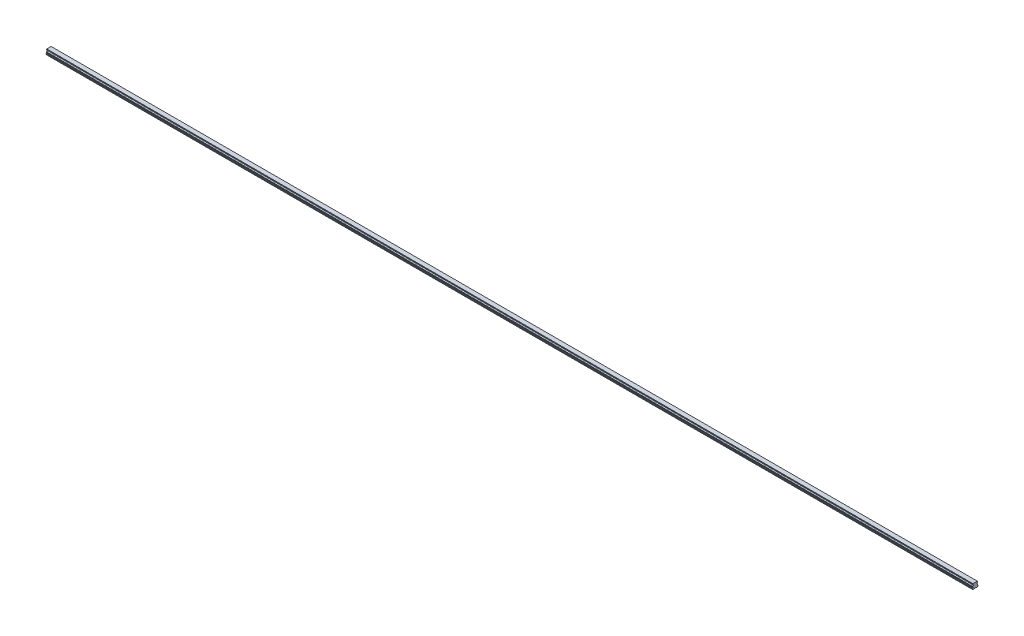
from build123d import *

# Parameters (mm, degrees)
BOSS_EXTRUDE1_DEPTH        = 3960
SKETCH3_R                  = 3
SKETCH3_R_2                = 2.5
CUT_EXTRUDE3_DEPTH         = 12
SKETCH3_2_R                = 2.5
CUT_EXTRUDE4_DEPTH         = 15
CHAMFER1_SIZE              = 0.5
LPATTERN4_COUNT            = 66
LPATTERN4_PITCH            = 60
CHAMFER1_OF_LPATTERN4_SIZE = 0.5


with BuildPart() as part:
    # Sketch1 → Boss-Extrude1 (new body)
    with BuildSketch(Plane(origin=(0, 0, 0), x_dir=(0, 0, -1), z_dir=(1, 0, 0))):
        with BuildLine():
            Line((9.375, 21.8), (-9.375, 21.8))
            Line((-9.375, 21.8), (-9.375, 20.756))
            Line((-9.375, 20.756), (-10, 19.415683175))
            Line((-10, 19.415683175), (-10, 17.685449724))
            ThreePointArc((-10, 17.685449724), (-7.2, 14.6), (-10, 11.514550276))
            Line((-10, 11.514550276), (-10, 9.784316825))
            Line((-10, 9.784316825), (-9.375, 8.444))
            Line((-9.375, 8.444), (-9.922688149, 6.4))
            Line((-9.922688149, 6.4), (-12.5, 5.489338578))
            Line((-12.5, 5.489338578), (-12.5, 2.65))
            Line((-12.5, 2.65), (-9.85, 0))
            Line((-9.85, 0), (-5.5, 0))
            Line((-5.5, 0), (-5, 0.5))
            Line((-5, 0.5), (5, 0.5))
            Line((5, 0.5), (5.5, 0))
            Line((5.5, 0), (9.85, 0))
            Line((9.85, 0), (12.5, 2.65))
            Line((12.5, 2.65), (12.5, 5.489338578))
            Line((12.5, 5.489338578), (9.922688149, 6.4))
            Line((9.922688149, 6.4), (9.375, 8.444))
            Line((9.375, 8.444), (10, 9.784316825))
            Line((10, 9.784316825), (10, 11.514550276))
            ThreePointArc((10, 11.514550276), (7.2, 14.6), (10, 17.685449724))
            Line((10, 17.685449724), (10, 19.415683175))
            Line((10, 19.415683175), (9.375, 20.756))
            Line((9.375, 20.756), (9.375, 21.8))
        make_face()
    extrude(amount=BOSS_EXTRUDE1_DEPTH)

    # Sketch3 → Cut-Extrude3 (cut)
    with BuildSketch(Plane.XZ):
        with Locations(Location((30, 0, 0), (0, 0, 270))):
            Circle(SKETCH3_R)
        with Locations(Location((30, 0, 0), (0, 0, 270))):
            Circle(SKETCH3_R_2, mode=Mode.SUBTRACT)
    cut_extrude3 = extrude(amount=-CUT_EXTRUDE3_DEPTH, mode=Mode.SUBTRACT)

    # Sketch3_2 → Cut-Extrude4 (cut)
    with BuildSketch(Plane.XZ):
        with Locations(Location((30, 0, 0), (0, 0, 270))):
            Circle(SKETCH3_2_R)
    cut_extrude4 = extrude(amount=-CUT_EXTRUDE4_DEPTH, mode=Mode.SUBTRACT)

    # Cut-Extrude5 cone 1 section (on through the dimple's axis) → Cut-Extrude5 (revolve, cut)
    with BuildSketch(Plane(origin=(30, 15, 0), x_dir=(0, 0, -1), z_dir=(1, 0, 0))):
        Polygon((0, 0), (2.5, 0), (0, 1.443375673), align=None)
    cut_extrude5 = revolve(axis=Axis((30, 15, 0), (0, 1, 0)), mode=Mode.SUBTRACT)

    # Chamfer1
    chamfer1_edges = [part.edges().sort_by_distance(p)[0] for p in [
        (30, 0.5, 3),
    ]]
    chamfer(chamfer1_edges, length=CHAMFER1_SIZE)

    # LPattern4: Cut-Extrude3, Cut-Extrude4, Cut-Extrude5 ×66
    with Locations(*[(i * LPATTERN4_PITCH, 0, 0) for i in range(1, LPATTERN4_COUNT)]):
        add(cut_extrude3, mode=Mode.SUBTRACT)
        add(cut_extrude4, mode=Mode.SUBTRACT)
        add(cut_extrude5, mode=Mode.SUBTRACT)

    # Chamfer1 of LPattern4
    chamfer1_of_lpattern4_edges = [part.edges().sort_by_distance(p)[0] for p in [
        (90, 0.5, 3),
        (150, 0.5, 3),
        (210, 0.5, 3),
        (270, 0.5, 3),
        (330, 0.5, 3),
        (390, 0.5, 3),
        (450, 0.5, 3),
        (510, 0.5, 3),
        (570, 0.5, 3),
        (630, 0.5, 3),
        (690, 0.5, 3),
        (750, 0.5, 3),
        (810, 0.5, 3),
        (870, 0.5, 3),
        (930, 0.5, 3),
        (990, 0.5, 3),
        (1050, 0.5, 3),
        (1110, 0.5, 3),
        (1170, 0.5, 3),
        (1230, 0.5, 3),
        (1290, 0.5, 3),
        (1350, 0.5, 3),
        (1410, 0.5, 3),
        (1470, 0.5, 3),
        (1530, 0.5, 3),
        (1590, 0.5, 3),
        (1650, 0.5, 3),
        (1710, 0.5, 3),
        (1770, 0.5, 3),
        (1830, 0.5, 3),
        (1890, 0.5, 3),
        (1950, 0.5, 3),
        (2010, 0.5, 3),
        (2070, 0.5, 3),
        (2130, 0.5, 3),
        (2190, 0.5, 3),
        (2250, 0.5, 3),
        (2310, 0.5, 3),
        (2370, 0.5, 3),
        (2430, 0.5, 3),
        (2490, 0.5, 3),
        (2550, 0.5, 3),
        (2610, 0.5, 3),
        (2670, 0.5, 3),
        (2730, 0.5, 3),
        (2790, 0.5, 3),
        (2850, 0.5, 3),
        (2910, 0.5, 3),
        (2970, 0.5, 3),
        (3030, 0.5, 3),
        (3090, 0.5, 3),
        (3150, 0.5, 3),
        (3210, 0.5, 3),
        (3270, 0.5, 3),
        (3330, 0.5, 3),
        (3390, 0.5, 3),
        (3450, 0.5, 3),
        (3510, 0.5, 3),
        (3570, 0.5, 3),
        (3630, 0.5, 3),
        (3690, 0.5, 3),
        (3750, 0.5, 3),
        (3810, 0.5, 3),
        (3870, 0.5, 3),
        (3930, 0.5, 3),
    ]]
    chamfer(chamfer1_of_lpattern4_edges, length=CHAMFER1_OF_LPATTERN4_SIZE)


solid = part.part
